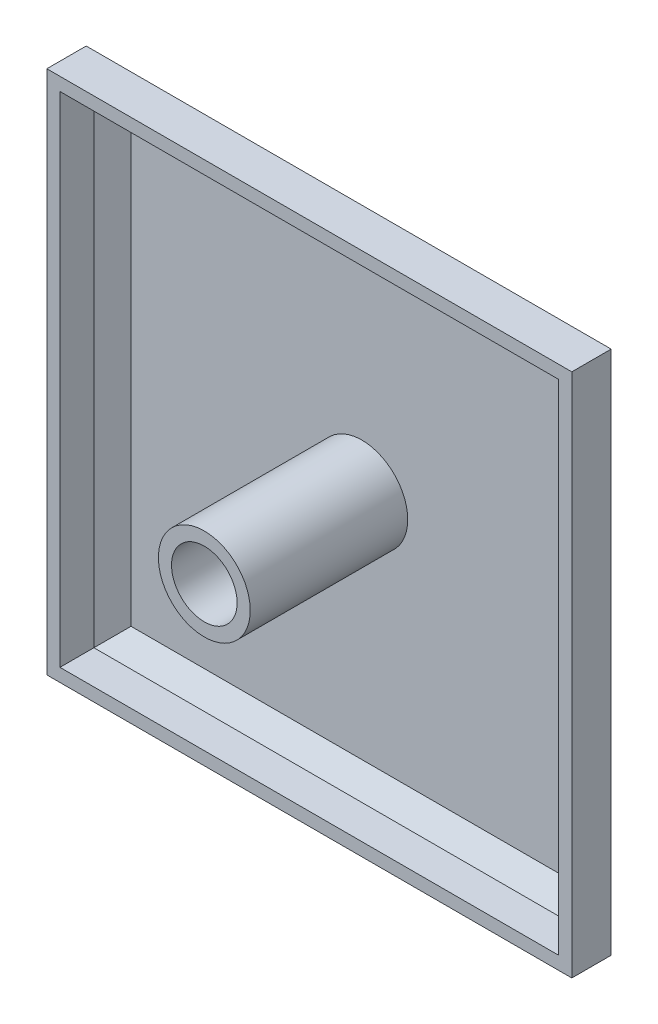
ISO-10303-21;
HEADER;
FILE_DESCRIPTION(('STEP AP214'),'2;1');
FILE_NAME('part.step','',(''),(''),'','','');
FILE_SCHEMA(('AUTOMOTIVE_DESIGN { 1 0 10303 214 1 1 1 1 }'));
ENDSEC;
DATA;
#1=APPLICATION_CONTEXT('core data for automotive mechanical design processes');
#2=APPLICATION_PROTOCOL_DEFINITION('international standard','automotive_design',2000,#1);
#3=PRODUCT_CONTEXT('',#1,'mechanical');
#4=PRODUCT('Part','Part','',(#3));
#5=PRODUCT_RELATED_PRODUCT_CATEGORY('part','',(#4));
#6=PRODUCT_DEFINITION_FORMATION('','',#4);
#7=PRODUCT_DEFINITION_CONTEXT('part definition',#1,'design');
#8=PRODUCT_DEFINITION('design','',#6,#7);
#9=PRODUCT_DEFINITION_SHAPE('','',#8);
#10=(LENGTH_UNIT() NAMED_UNIT(*) SI_UNIT(.MILLI.,.METRE.));
#11=(NAMED_UNIT(*) PLANE_ANGLE_UNIT() SI_UNIT($,.RADIAN.));
#12=(NAMED_UNIT(*) SI_UNIT($,.STERADIAN.) SOLID_ANGLE_UNIT());
#13=UNCERTAINTY_MEASURE_WITH_UNIT(LENGTH_MEASURE(1.E-05),#10,'distance_accuracy_value','');
#14=(GEOMETRIC_REPRESENTATION_CONTEXT(3) GLOBAL_UNCERTAINTY_ASSIGNED_CONTEXT((#13)) GLOBAL_UNIT_ASSIGNED_CONTEXT((#10,
#11,#12)) REPRESENTATION_CONTEXT('',''));
#15=CARTESIAN_POINT('',(0.,0.,0.));
#16=DIRECTION('',(0.,0.,1.));
#17=DIRECTION('',(1.,0.,0.));
#18=AXIS2_PLACEMENT_3D('',#15,#16,#17);
#19=CARTESIAN_POINT('',(0.,0.,-1.5));
#20=DIRECTION('',(0.,0.,1.));
#21=DIRECTION('',(1.,0.,0.));
#22=AXIS2_PLACEMENT_3D('',#19,#20,#21);
#23=PLANE('',#22);
#24=DIRECTION('',(1.,0.,0.));
#25=VECTOR('',#24,1.);
#26=CARTESIAN_POINT('',(-20.,-17.5857864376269,-1.5));
#27=LINE('',#26,#25);
#28=CARTESIAN_POINT('',(17.5857864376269,-17.5857864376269,-1.5));
#29=VERTEX_POINT('',#28);
#30=CARTESIAN_POINT('',(-17.5857864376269,-17.5857864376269,-1.5));
#31=VERTEX_POINT('',#30);
#32=EDGE_CURVE('E167',#29,#31,#27,.F.);
#33=ORIENTED_EDGE('',*,*,#32,.F.);
#34=DIRECTION('',(0.,1.,0.));
#35=VECTOR('',#34,1.);
#36=CARTESIAN_POINT('',(17.5857864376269,20.,-1.5));
#37=LINE('',#36,#35);
#38=CARTESIAN_POINT('',(17.5857864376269,17.5857864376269,-1.5));
#39=VERTEX_POINT('',#38);
#40=EDGE_CURVE('E157',#39,#29,#37,.F.);
#41=ORIENTED_EDGE('',*,*,#40,.F.);
#42=DIRECTION('',(-1.,0.,0.));
#43=VECTOR('',#42,1.);
#44=CARTESIAN_POINT('',(-20.,17.5857864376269,-1.5));
#45=LINE('',#44,#43);
#46=CARTESIAN_POINT('',(-17.5857864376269,17.5857864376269,-1.5));
#47=VERTEX_POINT('',#46);
#48=EDGE_CURVE('E168',#47,#39,#45,.F.);
#49=ORIENTED_EDGE('',*,*,#48,.F.);
#50=DIRECTION('',(0.,-1.,0.));
#51=VECTOR('',#50,1.);
#52=CARTESIAN_POINT('',(-17.5857864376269,20.,-1.5));
#53=LINE('',#52,#51);
#54=EDGE_CURVE('E137',#31,#47,#53,.F.);
#55=ORIENTED_EDGE('',*,*,#54,.F.);
#56=EDGE_LOOP('',(#33,#41,#49,#55));
#57=FACE_BOUND('',#56,.T.);
#58=CARTESIAN_POINT('',(0.,0.,-1.5));
#59=DIRECTION('',(0.,0.,1.));
#60=DIRECTION('',(1.,0.,0.));
#61=AXIS2_PLACEMENT_3D('',#58,#59,#60);
#62=CIRCLE('',#61,3.5);
#63=CARTESIAN_POINT('',(3.5,0.,-1.5));
#64=VERTEX_POINT('',#63);
#65=EDGE_CURVE('E475',#64,#64,#62,.T.);
#66=ORIENTED_EDGE('',*,*,#65,.F.);
#67=EDGE_LOOP('',(#66));
#68=FACE_BOUND('',#67,.T.);
#69=ADVANCED_FACE('F33',(#57,#68),#23,.T.);
#70=CARTESIAN_POINT('',(-20.,20.,2.5));
#71=DIRECTION('',(1.,0.,0.));
#72=DIRECTION('',(0.,0.,-1.));
#73=AXIS2_PLACEMENT_3D('',#70,#71,#72);
#74=PLANE('',#73);
#75=DIRECTION('',(0.,0.,-1.));
#76=VECTOR('',#75,1.);
#77=CARTESIAN_POINT('',(-20.,20.,2.5));
#78=LINE('',#77,#76);
#79=CARTESIAN_POINT('',(-20.,20.,2.5));
#80=VERTEX_POINT('',#79);
#81=CARTESIAN_POINT('',(-20.,20.,-0.499999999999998));
#82=VERTEX_POINT('',#81);
#83=EDGE_CURVE('E194',#80,#82,#78,.T.);
#84=ORIENTED_EDGE('',*,*,#83,.T.);
#85=DIRECTION('',(0.,-1.,0.));
#86=VECTOR('',#85,1.);
#87=CARTESIAN_POINT('',(-20.,20.,-0.499999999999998));
#88=LINE('',#87,#86);
#89=CARTESIAN_POINT('',(-20.,-20.,-0.499999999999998));
#90=VERTEX_POINT('',#89);
#91=EDGE_CURVE('E204',#82,#90,#88,.T.);
#92=ORIENTED_EDGE('',*,*,#91,.T.);
#93=DIRECTION('',(0.,0.,-1.));
#94=VECTOR('',#93,1.);
#95=CARTESIAN_POINT('',(-20.,-20.,2.5));
#96=LINE('',#95,#94);
#97=CARTESIAN_POINT('',(-20.,-20.,2.5));
#98=VERTEX_POINT('',#97);
#99=EDGE_CURVE('E201',#98,#90,#96,.T.);
#100=ORIENTED_EDGE('',*,*,#99,.F.);
#101=DIRECTION('',(0.,-1.,0.));
#102=VECTOR('',#101,1.);
#103=CARTESIAN_POINT('',(-20.,20.,2.5));
#104=LINE('',#103,#102);
#105=EDGE_CURVE('E184',#80,#98,#104,.T.);
#106=ORIENTED_EDGE('',*,*,#105,.F.);
#107=EDGE_LOOP('',(#84,#92,#100,#106));
#108=FACE_BOUND('',#107,.T.);
#109=ADVANCED_FACE('F251',(#108),#74,.F.);
#110=CARTESIAN_POINT('',(-20.,-20.,2.5));
#111=DIRECTION('',(0.,1.,0.));
#112=DIRECTION('',(0.,0.,1.));
#113=AXIS2_PLACEMENT_3D('',#110,#111,#112);
#114=PLANE('',#113);
#115=ORIENTED_EDGE('',*,*,#99,.T.);
#116=DIRECTION('',(1.,0.,0.));
#117=VECTOR('',#116,1.);
#118=CARTESIAN_POINT('',(-20.,-20.,-0.499999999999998));
#119=LINE('',#118,#117);
#120=CARTESIAN_POINT('',(20.,-20.,-0.499999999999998));
#121=VERTEX_POINT('',#120);
#122=EDGE_CURVE('E216',#90,#121,#119,.T.);
#123=ORIENTED_EDGE('',*,*,#122,.T.);
#124=DIRECTION('',(0.,0.,-1.));
#125=VECTOR('',#124,1.);
#126=CARTESIAN_POINT('',(20.,-20.,2.5));
#127=LINE('',#126,#125);
#128=CARTESIAN_POINT('',(20.,-20.,2.5));
#129=VERTEX_POINT('',#128);
#130=EDGE_CURVE('E199',#129,#121,#127,.T.);
#131=ORIENTED_EDGE('',*,*,#130,.F.);
#132=DIRECTION('',(1.,0.,0.));
#133=VECTOR('',#132,1.);
#134=CARTESIAN_POINT('',(-20.,-20.,2.5));
#135=LINE('',#134,#133);
#136=EDGE_CURVE('E187',#98,#129,#135,.T.);
#137=ORIENTED_EDGE('',*,*,#136,.F.);
#138=EDGE_LOOP('',(#115,#123,#131,#137));
#139=FACE_BOUND('',#138,.T.);
#140=ADVANCED_FACE('F254',(#139),#114,.F.);
#141=CARTESIAN_POINT('',(20.,20.,2.5));
#142=DIRECTION('',(-1.,0.,0.));
#143=DIRECTION('',(0.,-1.,0.));
#144=AXIS2_PLACEMENT_3D('',#141,#142,#143);
#145=PLANE('',#144);
#146=ORIENTED_EDGE('',*,*,#130,.T.);
#147=DIRECTION('',(0.,1.,0.));
#148=VECTOR('',#147,1.);
#149=CARTESIAN_POINT('',(20.,20.,-0.499999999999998));
#150=LINE('',#149,#148);
#151=CARTESIAN_POINT('',(20.,20.,-0.499999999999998));
#152=VERTEX_POINT('',#151);
#153=EDGE_CURVE('E56',#121,#152,#150,.T.);
#154=ORIENTED_EDGE('',*,*,#153,.T.);
#155=DIRECTION('',(0.,0.,-1.));
#156=VECTOR('',#155,1.);
#157=CARTESIAN_POINT('',(20.,20.,2.5));
#158=LINE('',#157,#156);
#159=CARTESIAN_POINT('',(20.,20.,2.5));
#160=VERTEX_POINT('',#159);
#161=EDGE_CURVE('E197',#160,#152,#158,.T.);
#162=ORIENTED_EDGE('',*,*,#161,.F.);
#163=DIRECTION('',(0.,1.,0.));
#164=VECTOR('',#163,1.);
#165=CARTESIAN_POINT('',(20.,20.,2.5));
#166=LINE('',#165,#164);
#167=EDGE_CURVE('E190',#129,#160,#166,.T.);
#168=ORIENTED_EDGE('',*,*,#167,.F.);
#169=EDGE_LOOP('',(#146,#154,#162,#168));
#170=FACE_BOUND('',#169,.T.);
#171=ADVANCED_FACE('F261',(#170),#145,.F.);
#172=CARTESIAN_POINT('',(-20.,20.,2.5));
#173=DIRECTION('',(0.,-1.,0.));
#174=DIRECTION('',(0.,0.,-1.));
#175=AXIS2_PLACEMENT_3D('',#172,#173,#174);
#176=PLANE('',#175);
#177=ORIENTED_EDGE('',*,*,#161,.T.);
#178=DIRECTION('',(-1.,0.,0.));
#179=VECTOR('',#178,1.);
#180=CARTESIAN_POINT('',(-20.,20.,-0.499999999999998));
#181=LINE('',#180,#179);
#182=EDGE_CURVE('E41',#152,#82,#181,.T.);
#183=ORIENTED_EDGE('',*,*,#182,.T.);
#184=ORIENTED_EDGE('',*,*,#83,.F.);
#185=DIRECTION('',(-1.,0.,0.));
#186=VECTOR('',#185,1.);
#187=CARTESIAN_POINT('',(-20.,20.,2.5));
#188=LINE('',#187,#186);
#189=EDGE_CURVE('E192',#160,#80,#188,.T.);
#190=ORIENTED_EDGE('',*,*,#189,.F.);
#191=EDGE_LOOP('',(#177,#183,#184,#190));
#192=FACE_BOUND('',#191,.T.);
#193=ADVANCED_FACE('F260',(#192),#176,.F.);
#194=CARTESIAN_POINT('',(0.,0.,2.5));
#195=DIRECTION('',(0.,0.,1.));
#196=DIRECTION('',(1.,0.,0.));
#197=AXIS2_PLACEMENT_3D('',#194,#195,#196);
#198=PLANE('',#197);
#199=DIRECTION('',(0.,-1.,0.));
#200=VECTOR('',#199,1.);
#201=CARTESIAN_POINT('',(-19.,20.,2.5));
#202=LINE('',#201,#200);
#203=CARTESIAN_POINT('',(-19.,19.,2.5));
#204=VERTEX_POINT('',#203);
#205=CARTESIAN_POINT('',(-19.,-19.,2.5));
#206=VERTEX_POINT('',#205);
#207=EDGE_CURVE('E161',#204,#206,#202,.T.);
#208=ORIENTED_EDGE('',*,*,#207,.F.);
#209=DIRECTION('',(-1.,0.,0.));
#210=VECTOR('',#209,1.);
#211=CARTESIAN_POINT('',(-20.,19.,2.5));
#212=LINE('',#211,#210);
#213=CARTESIAN_POINT('',(19.,19.,2.5));
#214=VERTEX_POINT('',#213);
#215=EDGE_CURVE('E181',#214,#204,#212,.T.);
#216=ORIENTED_EDGE('',*,*,#215,.F.);
#217=DIRECTION('',(0.,1.,0.));
#218=VECTOR('',#217,1.);
#219=CARTESIAN_POINT('',(19.,20.,2.5));
#220=LINE('',#219,#218);
#221=CARTESIAN_POINT('',(19.,-19.,2.5));
#222=VERTEX_POINT('',#221);
#223=EDGE_CURVE('E179',#222,#214,#220,.T.);
#224=ORIENTED_EDGE('',*,*,#223,.F.);
#225=DIRECTION('',(1.,0.,0.));
#226=VECTOR('',#225,1.);
#227=CARTESIAN_POINT('',(-20.,-19.,2.5));
#228=LINE('',#227,#226);
#229=EDGE_CURVE('E144',#206,#222,#228,.T.);
#230=ORIENTED_EDGE('',*,*,#229,.F.);
#231=EDGE_LOOP('',(#208,#216,#224,#230));
#232=FACE_BOUND('',#231,.T.);
#233=ORIENTED_EDGE('',*,*,#105,.T.);
#234=ORIENTED_EDGE('',*,*,#136,.T.);
#235=ORIENTED_EDGE('',*,*,#167,.T.);
#236=ORIENTED_EDGE('',*,*,#189,.T.);
#237=EDGE_LOOP('',(#233,#234,#235,#236));
#238=FACE_BOUND('',#237,.T.);
#239=ADVANCED_FACE('F257',(#232,#238),#198,.T.);
#240=CARTESIAN_POINT('',(0.,0.,-2.5));
#241=DIRECTION('',(0.,0.,1.));
#242=DIRECTION('',(1.,0.,0.));
#243=AXIS2_PLACEMENT_3D('',#240,#241,#242);
#244=PLANE('',#243);
#245=DIRECTION('',(-1.,0.,0.));
#246=VECTOR('',#245,1.);
#247=CARTESIAN_POINT('',(0.,-18.,-2.5));
#248=LINE('',#247,#246);
#249=CARTESIAN_POINT('',(18.,-18.,-2.5));
#250=VERTEX_POINT('',#249);
#251=CARTESIAN_POINT('',(-18.,-18.,-2.5));
#252=VERTEX_POINT('',#251);
#253=EDGE_CURVE('E211',#250,#252,#248,.T.);
#254=ORIENTED_EDGE('',*,*,#253,.T.);
#255=DIRECTION('',(0.,1.,0.));
#256=VECTOR('',#255,1.);
#257=CARTESIAN_POINT('',(-18.,0.,-2.5));
#258=LINE('',#257,#256);
#259=CARTESIAN_POINT('',(-18.,18.,-2.5));
#260=VERTEX_POINT('',#259);
#261=EDGE_CURVE('E213',#252,#260,#258,.T.);
#262=ORIENTED_EDGE('',*,*,#261,.T.);
#263=DIRECTION('',(1.,0.,0.));
#264=VECTOR('',#263,1.);
#265=CARTESIAN_POINT('',(0.,18.,-2.5));
#266=LINE('',#265,#264);
#267=CARTESIAN_POINT('',(18.,18.,-2.5));
#268=VERTEX_POINT('',#267);
#269=EDGE_CURVE('E207',#260,#268,#266,.T.);
#270=ORIENTED_EDGE('',*,*,#269,.T.);
#271=DIRECTION('',(0.,-1.,0.));
#272=VECTOR('',#271,1.);
#273=CARTESIAN_POINT('',(18.,0.,-2.5));
#274=LINE('',#273,#272);
#275=EDGE_CURVE('E209',#268,#250,#274,.T.);
#276=ORIENTED_EDGE('',*,*,#275,.T.);
#277=EDGE_LOOP('',(#254,#262,#270,#276));
#278=FACE_BOUND('',#277,.T.);
#279=ADVANCED_FACE('F238',(#278),#244,.F.);
#280=CARTESIAN_POINT('',(20.,20.,-0.499999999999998));
#281=DIRECTION('',(-0.707106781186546,0.,0.707106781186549));
#282=DIRECTION('',(0.,1.,0.));
#283=AXIS2_PLACEMENT_3D('',#280,#281,#282);
#284=PLANE('',#283);
#285=DIRECTION('',(-0.577350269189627,0.577350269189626,-0.577350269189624));
#286=VECTOR('',#285,1.);
#287=CARTESIAN_POINT('',(6.66666666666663,-6.66666666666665,-13.8333333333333));
#288=LINE('',#287,#286);
#289=EDGE_CURVE('E224',#250,#121,#288,.F.);
#290=ORIENTED_EDGE('',*,*,#289,.F.);
#291=ORIENTED_EDGE('',*,*,#275,.F.);
#292=DIRECTION('',(-0.577350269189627,-0.577350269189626,-0.577350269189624));
#293=VECTOR('',#292,1.);
#294=CARTESIAN_POINT('',(6.66666666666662,6.66666666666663,-13.8333333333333));
#295=LINE('',#294,#293);
#296=EDGE_CURVE('E188',#152,#268,#295,.T.);
#297=ORIENTED_EDGE('',*,*,#296,.F.);
#298=ORIENTED_EDGE('',*,*,#153,.F.);
#299=EDGE_LOOP('',(#290,#291,#297,#298));
#300=FACE_BOUND('',#299,.T.);
#301=ADVANCED_FACE('F35',(#300),#284,.F.);
#302=CARTESIAN_POINT('',(-20.,20.,-0.499999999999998));
#303=DIRECTION('',(0.,-0.707106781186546,0.707106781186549));
#304=DIRECTION('',(-1.,0.,0.));
#305=AXIS2_PLACEMENT_3D('',#302,#303,#304);
#306=PLANE('',#305);
#307=ORIENTED_EDGE('',*,*,#296,.T.);
#308=ORIENTED_EDGE('',*,*,#269,.F.);
#309=DIRECTION('',(-0.577350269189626,0.577350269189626,0.577350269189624));
#310=VECTOR('',#309,1.);
#311=CARTESIAN_POINT('',(-20.,20.,-0.499999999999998));
#312=LINE('',#311,#310);
#313=EDGE_CURVE('E222',#82,#260,#312,.F.);
#314=ORIENTED_EDGE('',*,*,#313,.F.);
#315=ORIENTED_EDGE('',*,*,#182,.F.);
#316=EDGE_LOOP('',(#307,#308,#314,#315));
#317=FACE_BOUND('',#316,.T.);
#318=ADVANCED_FACE('F231',(#317),#306,.F.);
#319=CARTESIAN_POINT('',(-20.,-20.,-0.499999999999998));
#320=DIRECTION('',(0.,0.707106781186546,0.707106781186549));
#321=DIRECTION('',(1.,0.,0.));
#322=AXIS2_PLACEMENT_3D('',#319,#320,#321);
#323=PLANE('',#322);
#324=ORIENTED_EDGE('',*,*,#289,.T.);
#325=ORIENTED_EDGE('',*,*,#122,.F.);
#326=DIRECTION('',(0.577350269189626,0.577350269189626,-0.577350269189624));
#327=VECTOR('',#326,1.);
#328=CARTESIAN_POINT('',(-20.,-20.,-0.499999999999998));
#329=LINE('',#328,#327);
#330=EDGE_CURVE('E220',#252,#90,#329,.F.);
#331=ORIENTED_EDGE('',*,*,#330,.F.);
#332=ORIENTED_EDGE('',*,*,#253,.F.);
#333=EDGE_LOOP('',(#324,#325,#331,#332));
#334=FACE_BOUND('',#333,.T.);
#335=ADVANCED_FACE('F246',(#334),#323,.F.);
#336=CARTESIAN_POINT('',(-20.,20.,-0.499999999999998));
#337=DIRECTION('',(0.707106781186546,0.,0.707106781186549));
#338=DIRECTION('',(0.,-1.,0.));
#339=AXIS2_PLACEMENT_3D('',#336,#337,#338);
#340=PLANE('',#339);
#341=ORIENTED_EDGE('',*,*,#313,.T.);
#342=ORIENTED_EDGE('',*,*,#261,.F.);
#343=ORIENTED_EDGE('',*,*,#330,.T.);
#344=ORIENTED_EDGE('',*,*,#91,.F.);
#345=EDGE_LOOP('',(#341,#342,#343,#344));
#346=FACE_BOUND('',#345,.T.);
#347=ADVANCED_FACE('F242',(#346),#340,.F.);
#348=CARTESIAN_POINT('',(-19.,20.,2.5));
#349=DIRECTION('',(1.,0.,0.));
#350=DIRECTION('',(0.,0.,-1.));
#351=AXIS2_PLACEMENT_3D('',#348,#349,#350);
#352=PLANE('',#351);
#353=DIRECTION('',(0.,0.,-1.));
#354=VECTOR('',#353,1.);
#355=CARTESIAN_POINT('',(-19.,19.,2.5));
#356=LINE('',#355,#354);
#357=CARTESIAN_POINT('',(-19.,19.,-0.085786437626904));
#358=VERTEX_POINT('',#357);
#359=EDGE_CURVE('E183',#204,#358,#356,.T.);
#360=ORIENTED_EDGE('',*,*,#359,.F.);
#361=ORIENTED_EDGE('',*,*,#207,.T.);
#362=DIRECTION('',(0.,0.,-1.));
#363=VECTOR('',#362,1.);
#364=CARTESIAN_POINT('',(-19.,-19.,2.5));
#365=LINE('',#364,#363);
#366=CARTESIAN_POINT('',(-19.,-19.,-0.0857864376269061));
#367=VERTEX_POINT('',#366);
#368=EDGE_CURVE('E147',#206,#367,#365,.T.);
#369=ORIENTED_EDGE('',*,*,#368,.T.);
#370=DIRECTION('',(0.,1.,0.));
#371=VECTOR('',#370,1.);
#372=CARTESIAN_POINT('',(-19.,20.,-0.0857864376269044));
#373=LINE('',#372,#371);
#374=EDGE_CURVE('E173',#358,#367,#373,.F.);
#375=ORIENTED_EDGE('',*,*,#374,.F.);
#376=EDGE_LOOP('',(#360,#361,#369,#375));
#377=FACE_BOUND('',#376,.T.);
#378=ADVANCED_FACE('F304',(#377),#352,.T.);
#379=CARTESIAN_POINT('',(-20.,-19.,2.5));
#380=DIRECTION('',(0.,1.,0.));
#381=DIRECTION('',(0.,0.,1.));
#382=AXIS2_PLACEMENT_3D('',#379,#380,#381);
#383=PLANE('',#382);
#384=ORIENTED_EDGE('',*,*,#368,.F.);
#385=ORIENTED_EDGE('',*,*,#229,.T.);
#386=DIRECTION('',(0.,0.,-1.));
#387=VECTOR('',#386,1.);
#388=CARTESIAN_POINT('',(19.,-19.,2.5));
#389=LINE('',#388,#387);
#390=CARTESIAN_POINT('',(19.,-19.,-0.0857864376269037));
#391=VERTEX_POINT('',#390);
#392=EDGE_CURVE('E140',#222,#391,#389,.T.);
#393=ORIENTED_EDGE('',*,*,#392,.T.);
#394=DIRECTION('',(-1.,0.,0.));
#395=VECTOR('',#394,1.);
#396=CARTESIAN_POINT('',(-20.,-19.,-0.0857864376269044));
#397=LINE('',#396,#395);
#398=EDGE_CURVE('E125',#367,#391,#397,.F.);
#399=ORIENTED_EDGE('',*,*,#398,.F.);
#400=EDGE_LOOP('',(#384,#385,#393,#399));
#401=FACE_BOUND('',#400,.T.);
#402=ADVANCED_FACE('F142',(#401),#383,.T.);
#403=CARTESIAN_POINT('',(19.,20.,2.5));
#404=DIRECTION('',(-1.,0.,0.));
#405=DIRECTION('',(0.,-1.,0.));
#406=AXIS2_PLACEMENT_3D('',#403,#404,#405);
#407=PLANE('',#406);
#408=ORIENTED_EDGE('',*,*,#392,.F.);
#409=ORIENTED_EDGE('',*,*,#223,.T.);
#410=DIRECTION('',(0.,0.,-1.));
#411=VECTOR('',#410,1.);
#412=CARTESIAN_POINT('',(19.,19.,2.5));
#413=LINE('',#412,#411);
#414=CARTESIAN_POINT('',(19.,19.,-0.0857864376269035));
#415=VERTEX_POINT('',#414);
#416=EDGE_CURVE('E48',#214,#415,#413,.T.);
#417=ORIENTED_EDGE('',*,*,#416,.T.);
#418=DIRECTION('',(0.,-1.,0.));
#419=VECTOR('',#418,1.);
#420=CARTESIAN_POINT('',(19.,20.,-0.0857864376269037));
#421=LINE('',#420,#419);
#422=EDGE_CURVE('E136',#391,#415,#421,.F.);
#423=ORIENTED_EDGE('',*,*,#422,.F.);
#424=EDGE_LOOP('',(#408,#409,#417,#423));
#425=FACE_BOUND('',#424,.T.);
#426=ADVANCED_FACE('F149',(#425),#407,.T.);
#427=CARTESIAN_POINT('',(-20.,19.,2.5));
#428=DIRECTION('',(0.,-1.,0.));
#429=DIRECTION('',(0.,0.,-1.));
#430=AXIS2_PLACEMENT_3D('',#427,#428,#429);
#431=PLANE('',#430);
#432=ORIENTED_EDGE('',*,*,#416,.F.);
#433=ORIENTED_EDGE('',*,*,#215,.T.);
#434=ORIENTED_EDGE('',*,*,#359,.T.);
#435=DIRECTION('',(1.,0.,0.));
#436=VECTOR('',#435,1.);
#437=CARTESIAN_POINT('',(-20.,19.,-0.0857864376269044));
#438=LINE('',#437,#436);
#439=EDGE_CURVE('E153',#415,#358,#438,.F.);
#440=ORIENTED_EDGE('',*,*,#439,.F.);
#441=EDGE_LOOP('',(#432,#433,#434,#440));
#442=FACE_BOUND('',#441,.T.);
#443=ADVANCED_FACE('F311',(#442),#431,.T.);
#444=CARTESIAN_POINT('',(19.2928932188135,20.,0.207106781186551));
#445=DIRECTION('',(-0.707106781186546,0.,0.707106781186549));
#446=DIRECTION('',(0.,1.,0.));
#447=AXIS2_PLACEMENT_3D('',#444,#445,#446);
#448=PLANE('',#447);
#449=DIRECTION('',(0.577350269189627,-0.577350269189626,0.577350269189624));
#450=VECTOR('',#449,1.);
#451=CARTESIAN_POINT('',(6.19526214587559,-6.1952621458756,-12.8905242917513));
#452=LINE('',#451,#450);
#453=EDGE_CURVE('E129',#29,#391,#452,.T.);
#454=ORIENTED_EDGE('',*,*,#453,.T.);
#455=ORIENTED_EDGE('',*,*,#422,.T.);
#456=DIRECTION('',(-0.577350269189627,-0.577350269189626,-0.577350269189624));
#457=VECTOR('',#456,1.);
#458=CARTESIAN_POINT('',(6.19526214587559,6.1952621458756,-12.8905242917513));
#459=LINE('',#458,#457);
#460=EDGE_CURVE('E158',#415,#39,#459,.T.);
#461=ORIENTED_EDGE('',*,*,#460,.T.);
#462=ORIENTED_EDGE('',*,*,#40,.T.);
#463=EDGE_LOOP('',(#454,#455,#461,#462));
#464=FACE_BOUND('',#463,.T.);
#465=ADVANCED_FACE('F155',(#464),#448,.T.);
#466=CARTESIAN_POINT('',(-20.,19.2928932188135,0.207106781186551));
#467=DIRECTION('',(0.,-0.707106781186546,0.707106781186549));
#468=DIRECTION('',(-1.,0.,0.));
#469=AXIS2_PLACEMENT_3D('',#466,#467,#468);
#470=PLANE('',#469);
#471=ORIENTED_EDGE('',*,*,#460,.F.);
#472=ORIENTED_EDGE('',*,*,#439,.T.);
#473=DIRECTION('',(0.577350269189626,-0.577350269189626,-0.577350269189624));
#474=VECTOR('',#473,1.);
#475=CARTESIAN_POINT('',(-19.528595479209,19.528595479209,0.442809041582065));
#476=LINE('',#475,#474);
#477=EDGE_CURVE('E159',#358,#47,#476,.T.);
#478=ORIENTED_EDGE('',*,*,#477,.T.);
#479=ORIENTED_EDGE('',*,*,#48,.T.);
#480=EDGE_LOOP('',(#471,#472,#478,#479));
#481=FACE_BOUND('',#480,.T.);
#482=ADVANCED_FACE('F316',(#481),#470,.T.);
#483=CARTESIAN_POINT('',(-20.,-19.2928932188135,0.207106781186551));
#484=DIRECTION('',(0.,0.707106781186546,0.707106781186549));
#485=DIRECTION('',(1.,0.,0.));
#486=AXIS2_PLACEMENT_3D('',#483,#484,#485);
#487=PLANE('',#486);
#488=ORIENTED_EDGE('',*,*,#453,.F.);
#489=ORIENTED_EDGE('',*,*,#32,.T.);
#490=DIRECTION('',(-0.577350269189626,-0.577350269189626,0.577350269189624));
#491=VECTOR('',#490,1.);
#492=CARTESIAN_POINT('',(-6.19526214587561,-6.19526214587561,-12.8905242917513));
#493=LINE('',#492,#491);
#494=EDGE_CURVE('E132',#31,#367,#493,.T.);
#495=ORIENTED_EDGE('',*,*,#494,.T.);
#496=ORIENTED_EDGE('',*,*,#398,.T.);
#497=EDGE_LOOP('',(#488,#489,#495,#496));
#498=FACE_BOUND('',#497,.T.);
#499=ADVANCED_FACE('F127',(#498),#487,.T.);
#500=CARTESIAN_POINT('',(-19.2928932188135,20.,0.207106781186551));
#501=DIRECTION('',(0.707106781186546,0.,0.707106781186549));
#502=DIRECTION('',(0.,-1.,0.));
#503=AXIS2_PLACEMENT_3D('',#500,#501,#502);
#504=PLANE('',#503);
#505=ORIENTED_EDGE('',*,*,#477,.F.);
#506=ORIENTED_EDGE('',*,*,#374,.T.);
#507=ORIENTED_EDGE('',*,*,#494,.F.);
#508=ORIENTED_EDGE('',*,*,#54,.T.);
#509=EDGE_LOOP('',(#505,#506,#507,#508));
#510=FACE_BOUND('',#509,.T.);
#511=ADVANCED_FACE('F301',(#510),#504,.T.);
#512=CARTESIAN_POINT('',(0.,0.,10.5));
#513=DIRECTION('',(0.,0.,1.));
#514=DIRECTION('',(1.,0.,0.));
#515=AXIS2_PLACEMENT_3D('',#512,#513,#514);
#516=PLANE('',#515);
#517=CARTESIAN_POINT('',(0.,0.,10.5));
#518=DIRECTION('',(0.,0.,1.));
#519=DIRECTION('',(1.,0.,0.));
#520=AXIS2_PLACEMENT_3D('',#517,#518,#519);
#521=CIRCLE('',#520,3.5);
#522=CARTESIAN_POINT('',(3.5,0.,10.5));
#523=VERTEX_POINT('',#522);
#524=EDGE_CURVE('E176',#523,#523,#521,.T.);
#525=ORIENTED_EDGE('',*,*,#524,.T.);
#526=EDGE_LOOP('',(#525));
#527=FACE_BOUND('',#526,.T.);
#528=CARTESIAN_POINT('',(0.,0.,10.5));
#529=DIRECTION('',(0.,0.,1.));
#530=DIRECTION('',(1.,0.,0.));
#531=AXIS2_PLACEMENT_3D('',#528,#529,#530);
#532=CIRCLE('',#531,2.5);
#533=CARTESIAN_POINT('',(2.5,0.,10.5));
#534=VERTEX_POINT('',#533);
#535=EDGE_CURVE('E478',#534,#534,#532,.T.);
#536=ORIENTED_EDGE('',*,*,#535,.F.);
#537=EDGE_LOOP('',(#536));
#538=FACE_BOUND('',#537,.T.);
#539=ADVANCED_FACE('F295',(#527,#538),#516,.T.);
#540=CARTESIAN_POINT('',(0.,0.,10.5));
#541=DIRECTION('',(0.,0.,-1.));
#542=DIRECTION('',(-1.,0.,0.));
#543=AXIS2_PLACEMENT_3D('',#540,#541,#542);
#544=CYLINDRICAL_SURFACE('',#543,3.5);
#545=ORIENTED_EDGE('',*,*,#524,.F.);
#546=EDGE_LOOP('',(#545));
#547=FACE_BOUND('',#546,.T.);
#548=ORIENTED_EDGE('',*,*,#65,.T.);
#549=EDGE_LOOP('',(#548));
#550=FACE_BOUND('',#549,.T.);
#551=ADVANCED_FACE('F287',(#547,#550),#544,.T.);
#552=CARTESIAN_POINT('',(0.,0.,10.5));
#553=DIRECTION('',(0.,0.,-1.));
#554=DIRECTION('',(-1.,0.,0.));
#555=AXIS2_PLACEMENT_3D('',#552,#553,#554);
#556=CYLINDRICAL_SURFACE('',#555,2.5);
#557=ORIENTED_EDGE('',*,*,#535,.T.);
#558=EDGE_LOOP('',(#557));
#559=FACE_BOUND('',#558,.T.);
#560=CARTESIAN_POINT('',(0.,0.,-1.5));
#561=DIRECTION('',(0.,0.,1.));
#562=DIRECTION('',(1.,0.,0.));
#563=AXIS2_PLACEMENT_3D('',#560,#561,#562);
#564=CIRCLE('',#563,2.5);
#565=CARTESIAN_POINT('',(2.5,0.,-1.5));
#566=VERTEX_POINT('',#565);
#567=EDGE_CURVE('E11',#566,#566,#564,.F.);
#568=ORIENTED_EDGE('',*,*,#567,.T.);
#569=EDGE_LOOP('',(#568));
#570=FACE_BOUND('',#569,.T.);
#571=ADVANCED_FACE('F282',(#559,#570),#556,.F.);
#572=ORIENTED_EDGE('',*,*,#567,.F.);
#573=EDGE_LOOP('',(#572));
#574=FACE_BOUND('',#573,.T.);
#575=ADVANCED_FACE('F273',(#574),#23,.T.);
#576=CLOSED_SHELL('',(#69,#109,#140,#171,#193,#239,#279,#301,#318,#335,#347,#378,#402,#426,#443,
#465,#482,#499,#511,#539,#551,#571,#575));
#577=MANIFOLD_SOLID_BREP('B2',#576);
#578=ADVANCED_BREP_SHAPE_REPRESENTATION('',(#18,#577),#14);
#579=SHAPE_DEFINITION_REPRESENTATION(#9,#578);
ENDSEC;
END-ISO-10303-21;
